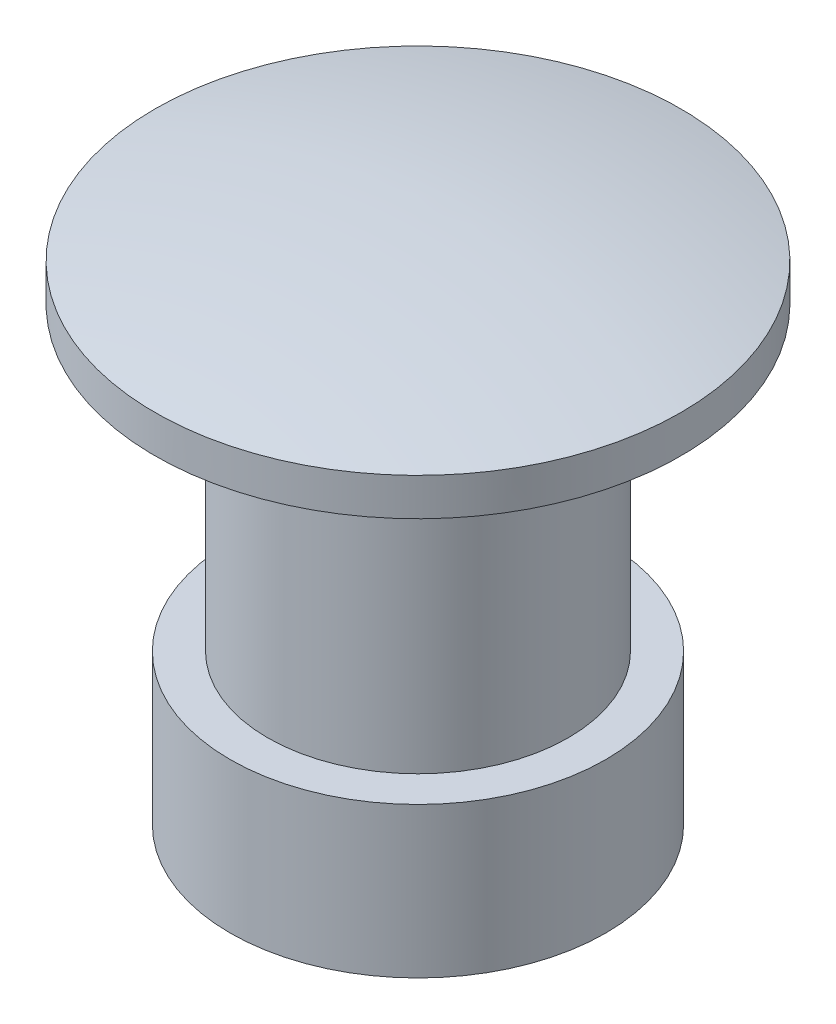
ISO-10303-21;
HEADER;
FILE_DESCRIPTION(('STEP AP214'),'2;1');
FILE_NAME('part.step','',(''),(''),'','','');
FILE_SCHEMA(('AUTOMOTIVE_DESIGN { 1 0 10303 214 1 1 1 1 }'));
ENDSEC;
DATA;
#1=APPLICATION_CONTEXT('core data for automotive mechanical design processes');
#2=APPLICATION_PROTOCOL_DEFINITION('international standard','automotive_design',2000,#1);
#3=PRODUCT_CONTEXT('',#1,'mechanical');
#4=PRODUCT('Part','Part','',(#3));
#5=PRODUCT_RELATED_PRODUCT_CATEGORY('part','',(#4));
#6=PRODUCT_DEFINITION_FORMATION('','',#4);
#7=PRODUCT_DEFINITION_CONTEXT('part definition',#1,'design');
#8=PRODUCT_DEFINITION('design','',#6,#7);
#9=PRODUCT_DEFINITION_SHAPE('','',#8);
#10=(LENGTH_UNIT() NAMED_UNIT(*) SI_UNIT(.MILLI.,.METRE.));
#11=(NAMED_UNIT(*) PLANE_ANGLE_UNIT() SI_UNIT($,.RADIAN.));
#12=(NAMED_UNIT(*) SI_UNIT($,.STERADIAN.) SOLID_ANGLE_UNIT());
#13=UNCERTAINTY_MEASURE_WITH_UNIT(LENGTH_MEASURE(1.E-05),#10,'distance_accuracy_value','');
#14=(GEOMETRIC_REPRESENTATION_CONTEXT(3) GLOBAL_UNCERTAINTY_ASSIGNED_CONTEXT((#13)) GLOBAL_UNIT_ASSIGNED_CONTEXT((#10,
#11,#12)) REPRESENTATION_CONTEXT('',''));
#15=CARTESIAN_POINT('',(0.,0.,0.));
#16=DIRECTION('',(0.,0.,1.));
#17=DIRECTION('',(1.,0.,0.));
#18=AXIS2_PLACEMENT_3D('',#15,#16,#17);
#19=CARTESIAN_POINT('',(-6.66133814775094E-13,-14.0859521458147,0.));
#20=DIRECTION('',(0.,1.00000000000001,0.));
#21=DIRECTION('',(1.00000000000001,0.,0.));
#22=AXIS2_PLACEMENT_3D('',#19,#20,#21);
#23=SPHERICAL_SURFACE('',#22,15.);
#24=CARTESIAN_POINT('',(1.11022302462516E-13,0.50000000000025,1.11022302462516E-13));
#25=DIRECTION('',(0.,1.00000000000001,0.));
#26=DIRECTION('',(-1.00000000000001,0.,0.));
#27=AXIS2_PLACEMENT_3D('',#24,#25,#26);
#28=CIRCLE('',#27,3.5);
#29=CARTESIAN_POINT('',(-3.49999999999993,0.500000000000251,1.13335556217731E-13));
#30=VERTEX_POINT('',#29);
#31=EDGE_CURVE('E51',#30,#30,#28,.T.);
#32=ORIENTED_EDGE('',*,*,#31,.T.);
#33=EDGE_LOOP('',(#32));
#34=FACE_BOUND('',#33,.T.);
#35=ADVANCED_FACE('F29',(#34),#23,.T.);
#36=CARTESIAN_POINT('',(2.49999999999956,-5.99999999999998,1.52655665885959E-13));
#37=DIRECTION('',(0.,1.00000000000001,0.));
#38=DIRECTION('',(-1.00000000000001,0.,0.));
#39=AXIS2_PLACEMENT_3D('',#36,#37,#38);
#40=PLANE('',#39);
#41=CARTESIAN_POINT('',(-1.16573417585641E-12,-5.99999999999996,0.));
#42=DIRECTION('',(0.,1.00000000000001,0.));
#43=DIRECTION('',(-1.00000000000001,0.,0.));
#44=AXIS2_PLACEMENT_3D('',#41,#42,#43);
#45=CIRCLE('',#44,2.5);
#46=CARTESIAN_POINT('',(-2.5000000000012,-5.99999999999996,0.));
#47=VERTEX_POINT('',#46);
#48=EDGE_CURVE('E10',#47,#47,#45,.T.);
#49=ORIENTED_EDGE('',*,*,#48,.F.);
#50=EDGE_LOOP('',(#49));
#51=FACE_BOUND('',#50,.T.);
#52=ADVANCED_FACE('F81',(#51),#40,.F.);
#53=CARTESIAN_POINT('',(-7.7715611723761E-13,8.64265423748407,0.));
#54=DIRECTION('',(0.,1.00000000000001,0.));
#55=DIRECTION('',(-1.00000000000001,0.,0.));
#56=AXIS2_PLACEMENT_3D('',#53,#54,#55);
#57=CYLINDRICAL_SURFACE('',#56,2.5);
#58=CARTESIAN_POINT('',(-6.10622663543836E-13,-3.99999999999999,0.));
#59=DIRECTION('',(0.,1.00000000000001,0.));
#60=DIRECTION('',(-1.00000000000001,0.,0.));
#61=AXIS2_PLACEMENT_3D('',#58,#59,#60);
#62=CIRCLE('',#61,2.5);
#63=CARTESIAN_POINT('',(-2.50000000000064,-3.99999999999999,0.));
#64=VERTEX_POINT('',#63);
#65=EDGE_CURVE('E35',#64,#64,#62,.T.);
#66=ORIENTED_EDGE('',*,*,#65,.F.);
#67=EDGE_LOOP('',(#66));
#68=FACE_BOUND('',#67,.T.);
#69=ORIENTED_EDGE('',*,*,#48,.T.);
#70=EDGE_LOOP('',(#69));
#71=FACE_BOUND('',#70,.T.);
#72=ADVANCED_FACE('F76',(#68,#71),#57,.T.);
#73=CARTESIAN_POINT('',(2.00000000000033,-3.99999999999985,4.85722573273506E-13));
#74=DIRECTION('',(0.,-1.00000000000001,0.));
#75=DIRECTION('',(1.00000000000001,0.,0.));
#76=AXIS2_PLACEMENT_3D('',#73,#74,#75);
#77=PLANE('',#76);
#78=CARTESIAN_POINT('',(-6.10622663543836E-13,-3.99999999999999,0.));
#79=DIRECTION('',(0.,1.00000000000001,0.));
#80=DIRECTION('',(-1.00000000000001,0.,0.));
#81=AXIS2_PLACEMENT_3D('',#78,#79,#80);
#82=CIRCLE('',#81,2.);
#83=CARTESIAN_POINT('',(-2.00000000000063,-3.99999999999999,0.));
#84=VERTEX_POINT('',#83);
#85=EDGE_CURVE('E39',#84,#84,#82,.T.);
#86=ORIENTED_EDGE('',*,*,#85,.F.);
#87=EDGE_LOOP('',(#86));
#88=FACE_BOUND('',#87,.T.);
#89=ORIENTED_EDGE('',*,*,#65,.T.);
#90=EDGE_LOOP('',(#89));
#91=FACE_BOUND('',#90,.T.);
#92=ADVANCED_FACE('F71',(#88,#91),#77,.F.);
#93=CARTESIAN_POINT('',(-7.7715611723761E-13,8.64265423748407,0.));
#94=DIRECTION('',(0.,1.00000000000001,0.));
#95=DIRECTION('',(-1.00000000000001,0.,0.));
#96=AXIS2_PLACEMENT_3D('',#93,#94,#95);
#97=CYLINDRICAL_SURFACE('',#96,2.);
#98=CARTESIAN_POINT('',(0.,0.,0.));
#99=DIRECTION('',(0.,1.00000000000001,0.));
#100=DIRECTION('',(-1.00000000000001,0.,0.));
#101=AXIS2_PLACEMENT_3D('',#98,#99,#100);
#102=CIRCLE('',#101,2.);
#103=CARTESIAN_POINT('',(-2.00000000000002,0.,0.));
#104=VERTEX_POINT('',#103);
#105=EDGE_CURVE('E43',#104,#104,#102,.T.);
#106=ORIENTED_EDGE('',*,*,#105,.F.);
#107=EDGE_LOOP('',(#106));
#108=FACE_BOUND('',#107,.T.);
#109=ORIENTED_EDGE('',*,*,#85,.T.);
#110=EDGE_LOOP('',(#109));
#111=FACE_BOUND('',#110,.T.);
#112=ADVANCED_FACE('F65',(#108,#111),#97,.T.);
#113=CARTESIAN_POINT('',(3.49999999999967,1.52655665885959E-13,1.80411241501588E-13));
#114=DIRECTION('',(0.,1.00000000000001,0.));
#115=DIRECTION('',(-1.00000000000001,0.,0.));
#116=AXIS2_PLACEMENT_3D('',#113,#114,#115);
#117=PLANE('',#116);
#118=CARTESIAN_POINT('',(0.,0.,0.));
#119=DIRECTION('',(0.,1.00000000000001,0.));
#120=DIRECTION('',(-1.00000000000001,0.,0.));
#121=AXIS2_PLACEMENT_3D('',#118,#119,#120);
#122=CIRCLE('',#121,3.5);
#123=CARTESIAN_POINT('',(-3.50000000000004,0.,0.));
#124=VERTEX_POINT('',#123);
#125=EDGE_CURVE('E48',#124,#124,#122,.T.);
#126=ORIENTED_EDGE('',*,*,#125,.F.);
#127=EDGE_LOOP('',(#126));
#128=FACE_BOUND('',#127,.T.);
#129=ORIENTED_EDGE('',*,*,#105,.T.);
#130=EDGE_LOOP('',(#129));
#131=FACE_BOUND('',#130,.T.);
#132=ADVANCED_FACE('F59',(#128,#131),#117,.F.);
#133=CARTESIAN_POINT('',(-7.7715611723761E-13,8.64265423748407,0.));
#134=DIRECTION('',(0.,1.00000000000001,0.));
#135=DIRECTION('',(-1.00000000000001,0.,0.));
#136=AXIS2_PLACEMENT_3D('',#133,#134,#135);
#137=CYLINDRICAL_SURFACE('',#136,3.5);
#138=ORIENTED_EDGE('',*,*,#31,.F.);
#139=EDGE_LOOP('',(#138));
#140=FACE_BOUND('',#139,.T.);
#141=ORIENTED_EDGE('',*,*,#125,.T.);
#142=EDGE_LOOP('',(#141));
#143=FACE_BOUND('',#142,.T.);
#144=ADVANCED_FACE('F56',(#140,#143),#137,.T.);
#145=CLOSED_SHELL('',(#35,#52,#72,#92,#112,#132,#144));
#146=MANIFOLD_SOLID_BREP('B2',#145);
#147=ADVANCED_BREP_SHAPE_REPRESENTATION('',(#18,#146),#14);
#148=SHAPE_DEFINITION_REPRESENTATION(#9,#147);
ENDSEC;
END-ISO-10303-21;
